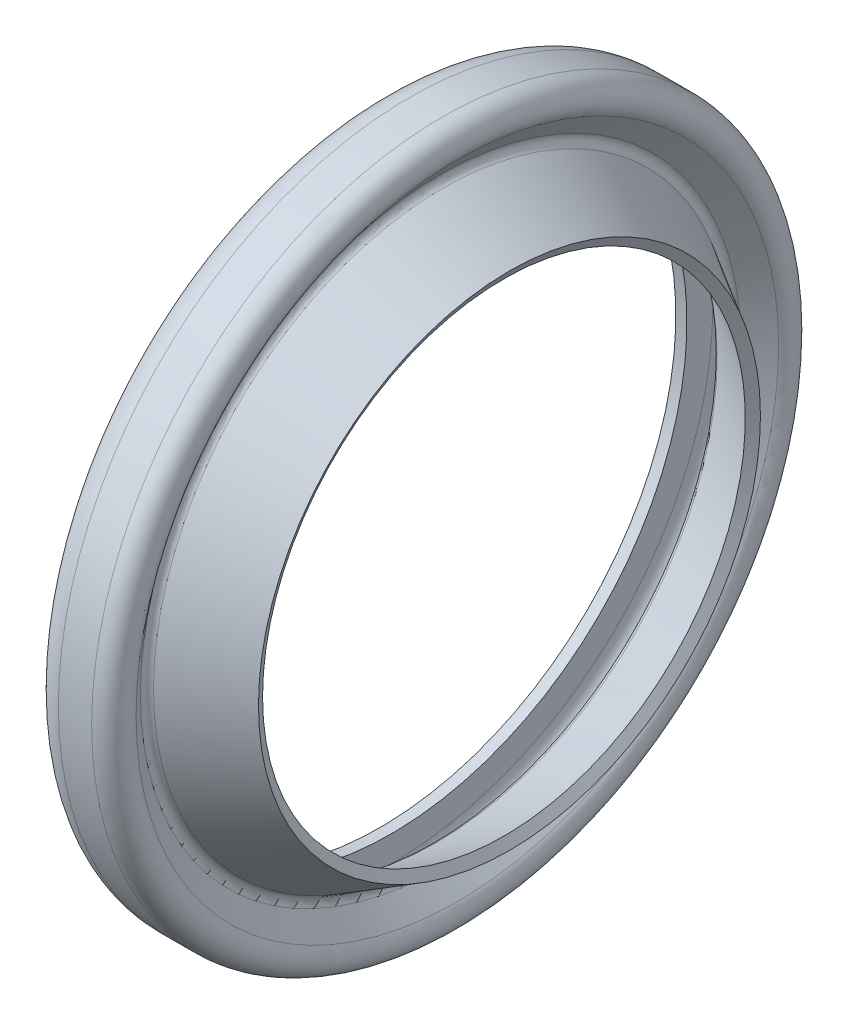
ISO-10303-21;
HEADER;
FILE_DESCRIPTION(('STEP AP214'),'2;1');
FILE_NAME('part.step','',(''),(''),'','','');
FILE_SCHEMA(('AUTOMOTIVE_DESIGN { 1 0 10303 214 1 1 1 1 }'));
ENDSEC;
DATA;
#1=APPLICATION_CONTEXT('core data for automotive mechanical design processes');
#2=APPLICATION_PROTOCOL_DEFINITION('international standard','automotive_design',2000,#1);
#3=PRODUCT_CONTEXT('',#1,'mechanical');
#4=PRODUCT('Part','Part','',(#3));
#5=PRODUCT_RELATED_PRODUCT_CATEGORY('part','',(#4));
#6=PRODUCT_DEFINITION_FORMATION('','',#4);
#7=PRODUCT_DEFINITION_CONTEXT('part definition',#1,'design');
#8=PRODUCT_DEFINITION('design','',#6,#7);
#9=PRODUCT_DEFINITION_SHAPE('','',#8);
#10=(LENGTH_UNIT() NAMED_UNIT(*) SI_UNIT(.MILLI.,.METRE.));
#11=(NAMED_UNIT(*) PLANE_ANGLE_UNIT() SI_UNIT($,.RADIAN.));
#12=(NAMED_UNIT(*) SI_UNIT($,.STERADIAN.) SOLID_ANGLE_UNIT());
#13=UNCERTAINTY_MEASURE_WITH_UNIT(LENGTH_MEASURE(1.E-05),#10,'distance_accuracy_value','');
#14=(GEOMETRIC_REPRESENTATION_CONTEXT(3) GLOBAL_UNCERTAINTY_ASSIGNED_CONTEXT((#13)) GLOBAL_UNIT_ASSIGNED_CONTEXT((#10,
#11,#12)) REPRESENTATION_CONTEXT('',''));
#15=CARTESIAN_POINT('',(0.,0.,0.));
#16=DIRECTION('',(0.,0.,1.));
#17=DIRECTION('',(1.,0.,0.));
#18=AXIS2_PLACEMENT_3D('',#15,#16,#17);
#19=CARTESIAN_POINT('',(0.,0.,0.));
#20=DIRECTION('',(-1.,0.,0.));
#21=DIRECTION('',(0.,0.,1.));
#22=AXIS2_PLACEMENT_3D('',#19,#20,#21);
#23=CYLINDRICAL_SURFACE('',#22,80.);
#24=CARTESIAN_POINT('',(3.,0.,0.));
#25=DIRECTION('',(-1.,0.,0.));
#26=DIRECTION('',(0.,0.,1.));
#27=AXIS2_PLACEMENT_3D('',#24,#25,#26);
#28=CIRCLE('',#27,80.);
#29=CARTESIAN_POINT('',(3.,0.,80.));
#30=VERTEX_POINT('',#29);
#31=EDGE_CURVE('E10',#30,#30,#28,.T.);
#32=ORIENTED_EDGE('',*,*,#31,.F.);
#33=EDGE_LOOP('',(#32));
#34=FACE_BOUND('',#33,.T.);
#35=CARTESIAN_POINT('',(0.,0.,0.));
#36=DIRECTION('',(-1.,0.,0.));
#37=DIRECTION('',(0.,0.,1.));
#38=AXIS2_PLACEMENT_3D('',#35,#36,#37);
#39=CIRCLE('',#38,80.);
#40=CARTESIAN_POINT('',(0.,0.,80.));
#41=VERTEX_POINT('',#40);
#42=EDGE_CURVE('E82',#41,#41,#39,.T.);
#43=ORIENTED_EDGE('',*,*,#42,.T.);
#44=EDGE_LOOP('',(#43));
#45=FACE_BOUND('',#44,.T.);
#46=ADVANCED_FACE('F30',(#34,#45),#23,.F.);
#47=CARTESIAN_POINT('',(3.,80.,0.));
#48=DIRECTION('',(-1.,0.,0.));
#49=DIRECTION('',(0.,0.,1.));
#50=AXIS2_PLACEMENT_3D('',#47,#48,#49);
#51=PLANE('',#50);
#52=CARTESIAN_POINT('',(3.,0.,0.));
#53=DIRECTION('',(-1.,0.,0.));
#54=DIRECTION('',(0.,0.,1.));
#55=AXIS2_PLACEMENT_3D('',#52,#53,#54);
#56=CIRCLE('',#55,87.);
#57=CARTESIAN_POINT('',(3.,0.,87.));
#58=VERTEX_POINT('',#57);
#59=EDGE_CURVE('E36',#58,#58,#56,.T.);
#60=ORIENTED_EDGE('',*,*,#59,.F.);
#61=EDGE_LOOP('',(#60));
#62=FACE_BOUND('',#61,.T.);
#63=ORIENTED_EDGE('',*,*,#31,.T.);
#64=EDGE_LOOP('',(#63));
#65=FACE_BOUND('',#64,.T.);
#66=ADVANCED_FACE('F167',(#62,#65),#51,.F.);
#67=CARTESIAN_POINT('',(8.,0.,0.));
#68=DIRECTION('',(-1.,0.,0.));
#69=DIRECTION('',(0.,0.,1.));
#70=AXIS2_PLACEMENT_3D('',#67,#68,#69);
#71=TOROIDAL_SURFACE('',#70,87.,5.);
#72=CARTESIAN_POINT('',(8.,0.,0.));
#73=DIRECTION('',(-1.,0.,0.));
#74=DIRECTION('',(0.,0.,1.));
#75=AXIS2_PLACEMENT_3D('',#72,#73,#74);
#76=CIRCLE('',#75,92.);
#77=CARTESIAN_POINT('',(8.,0.,92.));
#78=VERTEX_POINT('',#77);
#79=EDGE_CURVE('E40',#78,#78,#76,.T.);
#80=ORIENTED_EDGE('',*,*,#79,.F.);
#81=EDGE_LOOP('',(#80));
#82=FACE_BOUND('',#81,.T.);
#83=ORIENTED_EDGE('',*,*,#59,.T.);
#84=EDGE_LOOP('',(#83));
#85=FACE_BOUND('',#84,.T.);
#86=ADVANCED_FACE('F162',(#82,#85),#71,.F.);
#87=CARTESIAN_POINT('',(0.,0.,0.));
#88=DIRECTION('',(-1.,0.,0.));
#89=DIRECTION('',(0.,0.,1.));
#90=AXIS2_PLACEMENT_3D('',#87,#88,#89);
#91=CYLINDRICAL_SURFACE('',#90,92.);
#92=CARTESIAN_POINT('',(17.,0.,0.));
#93=DIRECTION('',(-1.,0.,0.));
#94=DIRECTION('',(0.,0.,1.));
#95=AXIS2_PLACEMENT_3D('',#92,#93,#94);
#96=CIRCLE('',#95,92.);
#97=CARTESIAN_POINT('',(17.,0.,92.));
#98=VERTEX_POINT('',#97);
#99=EDGE_CURVE('E44',#98,#98,#96,.T.);
#100=ORIENTED_EDGE('',*,*,#99,.F.);
#101=EDGE_LOOP('',(#100));
#102=FACE_BOUND('',#101,.T.);
#103=ORIENTED_EDGE('',*,*,#79,.T.);
#104=EDGE_LOOP('',(#103));
#105=FACE_BOUND('',#104,.T.);
#106=ADVANCED_FACE('F156',(#102,#105),#91,.F.);
#107=CARTESIAN_POINT('',(17.,0.,0.));
#108=DIRECTION('',(-1.,0.,0.));
#109=DIRECTION('',(0.,0.,1.));
#110=AXIS2_PLACEMENT_3D('',#107,#108,#109);
#111=TOROIDAL_SURFACE('',#110,90.,2.);
#112=CARTESIAN_POINT('',(18.5665549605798,0.,0.));
#113=DIRECTION('',(-1.,0.,0.));
#114=DIRECTION('',(0.,0.,1.));
#115=AXIS2_PLACEMENT_3D('',#112,#113,#114);
#116=CIRCLE('',#115,88.756655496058);
#117=CARTESIAN_POINT('',(18.5665549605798,0.,88.756655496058));
#118=VERTEX_POINT('',#117);
#119=EDGE_CURVE('E49',#118,#118,#116,.T.);
#120=ORIENTED_EDGE('',*,*,#119,.F.);
#121=EDGE_LOOP('',(#120));
#122=FACE_BOUND('',#121,.T.);
#123=ORIENTED_EDGE('',*,*,#99,.T.);
#124=EDGE_LOOP('',(#123));
#125=FACE_BOUND('',#124,.T.);
#126=ADVANCED_FACE('F150',(#122,#125),#111,.F.);
#127=CARTESIAN_POINT('',(18.5665549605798,0.,0.));
#128=DIRECTION('',(1.,0.,0.));
#129=DIRECTION('',(0.,0.,-1.));
#130=AXIS2_PLACEMENT_3D('',#127,#128,#129);
#131=CONICAL_SURFACE('',#130,88.756655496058,0.899920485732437);
#132=CARTESIAN_POINT('',(14.0836125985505,0.,0.));
#133=DIRECTION('',(-1.,0.,0.));
#134=DIRECTION('',(0.,0.,1.));
#135=AXIS2_PLACEMENT_3D('',#132,#133,#134);
#136=CIRCLE('',#135,83.1083612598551);
#137=CARTESIAN_POINT('',(14.0836125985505,0.,83.1083612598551));
#138=VERTEX_POINT('',#137);
#139=EDGE_CURVE('E52',#138,#138,#136,.T.);
#140=ORIENTED_EDGE('',*,*,#139,.F.);
#141=EDGE_LOOP('',(#140));
#142=FACE_BOUND('',#141,.T.);
#143=ORIENTED_EDGE('',*,*,#119,.T.);
#144=EDGE_LOOP('',(#143));
#145=FACE_BOUND('',#144,.T.);
#146=ADVANCED_FACE('F144',(#142,#145),#131,.T.);
#147=CARTESIAN_POINT('',(18.,0.,0.));
#148=DIRECTION('',(-1.,0.,0.));
#149=DIRECTION('',(0.,0.,1.));
#150=AXIS2_PLACEMENT_3D('',#147,#148,#149);
#151=TOROIDAL_SURFACE('',#150,80.,5.);
#152=CARTESIAN_POINT('',(15.5,0.,0.));
#153=DIRECTION('',(-1.,0.,0.));
#154=DIRECTION('',(0.,0.,1.));
#155=AXIS2_PLACEMENT_3D('',#152,#153,#154);
#156=CIRCLE('',#155,75.6698729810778);
#157=CARTESIAN_POINT('',(15.5,0.,75.6698729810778));
#158=VERTEX_POINT('',#157);
#159=EDGE_CURVE('E55',#158,#158,#156,.T.);
#160=ORIENTED_EDGE('',*,*,#159,.F.);
#161=EDGE_LOOP('',(#160));
#162=FACE_BOUND('',#161,.T.);
#163=ORIENTED_EDGE('',*,*,#139,.T.);
#164=EDGE_LOOP('',(#163));
#165=FACE_BOUND('',#164,.T.);
#166=ADVANCED_FACE('F138',(#162,#165),#151,.T.);
#167=CARTESIAN_POINT('',(15.5,0.,0.));
#168=DIRECTION('',(-1.,0.,0.));
#169=DIRECTION('',(0.,0.,1.));
#170=AXIS2_PLACEMENT_3D('',#167,#168,#169);
#171=CONICAL_SURFACE('',#170,75.6698729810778,0.523598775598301);
#172=CARTESIAN_POINT('',(33.5,0.,0.));
#173=DIRECTION('',(-1.,0.,0.));
#174=DIRECTION('',(0.,0.,1.));
#175=AXIS2_PLACEMENT_3D('',#172,#173,#174);
#176=CIRCLE('',#175,65.2775681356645);
#177=CARTESIAN_POINT('',(33.5,0.,65.2775681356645));
#178=VERTEX_POINT('',#177);
#179=EDGE_CURVE('E58',#178,#178,#176,.T.);
#180=ORIENTED_EDGE('',*,*,#179,.F.);
#181=EDGE_LOOP('',(#180));
#182=FACE_BOUND('',#181,.T.);
#183=ORIENTED_EDGE('',*,*,#159,.T.);
#184=EDGE_LOOP('',(#183));
#185=FACE_BOUND('',#184,.T.);
#186=ADVANCED_FACE('F132',(#182,#185),#171,.F.);
#187=CARTESIAN_POINT('',(33.5,0.,0.));
#188=DIRECTION('',(1.,0.,0.));
#189=DIRECTION('',(0.,0.,-1.));
#190=AXIS2_PLACEMENT_3D('',#187,#188,#189);
#191=CONICAL_SURFACE('',#190,65.2775681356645,1.0471975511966);
#192=CARTESIAN_POINT('',(35.,0.,0.));
#193=DIRECTION('',(-1.,0.,0.));
#194=DIRECTION('',(0.,0.,1.));
#195=AXIS2_PLACEMENT_3D('',#192,#193,#194);
#196=CIRCLE('',#195,67.8756443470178);
#197=CARTESIAN_POINT('',(35.,0.,67.8756443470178));
#198=VERTEX_POINT('',#197);
#199=EDGE_CURVE('E61',#198,#198,#196,.T.);
#200=ORIENTED_EDGE('',*,*,#199,.F.);
#201=EDGE_LOOP('',(#200));
#202=FACE_BOUND('',#201,.T.);
#203=ORIENTED_EDGE('',*,*,#179,.T.);
#204=EDGE_LOOP('',(#203));
#205=FACE_BOUND('',#204,.T.);
#206=ADVANCED_FACE('F126',(#202,#205),#191,.F.);
#207=CARTESIAN_POINT('',(35.,0.,0.));
#208=DIRECTION('',(-1.,0.,0.));
#209=DIRECTION('',(0.,0.,1.));
#210=AXIS2_PLACEMENT_3D('',#207,#208,#209);
#211=CONICAL_SURFACE('',#210,67.8756443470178,0.5235987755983);
#212=CARTESIAN_POINT('',(17.,0.,0.));
#213=DIRECTION('',(-1.,0.,0.));
#214=DIRECTION('',(0.,0.,1.));
#215=AXIS2_PLACEMENT_3D('',#212,#213,#214);
#216=CIRCLE('',#215,78.2679491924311);
#217=CARTESIAN_POINT('',(17.,0.,78.2679491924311));
#218=VERTEX_POINT('',#217);
#219=EDGE_CURVE('E64',#218,#218,#216,.T.);
#220=ORIENTED_EDGE('',*,*,#219,.F.);
#221=EDGE_LOOP('',(#220));
#222=FACE_BOUND('',#221,.T.);
#223=ORIENTED_EDGE('',*,*,#199,.T.);
#224=EDGE_LOOP('',(#223));
#225=FACE_BOUND('',#224,.T.);
#226=ADVANCED_FACE('F120',(#222,#225),#211,.T.);
#227=CARTESIAN_POINT('',(18.,0.,0.));
#228=DIRECTION('',(-1.,0.,0.));
#229=DIRECTION('',(0.,0.,1.));
#230=AXIS2_PLACEMENT_3D('',#227,#228,#229);
#231=TOROIDAL_SURFACE('',#230,80.,2.);
#232=CARTESIAN_POINT('',(16.4334450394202,0.,0.));
#233=DIRECTION('',(-1.,0.,0.));
#234=DIRECTION('',(0.,0.,1.));
#235=AXIS2_PLACEMENT_3D('',#232,#233,#234);
#236=CIRCLE('',#235,81.243344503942);
#237=CARTESIAN_POINT('',(16.4334450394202,0.,81.243344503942));
#238=VERTEX_POINT('',#237);
#239=EDGE_CURVE('E67',#238,#238,#236,.T.);
#240=ORIENTED_EDGE('',*,*,#239,.F.);
#241=EDGE_LOOP('',(#240));
#242=FACE_BOUND('',#241,.T.);
#243=ORIENTED_EDGE('',*,*,#219,.T.);
#244=EDGE_LOOP('',(#243));
#245=FACE_BOUND('',#244,.T.);
#246=ADVANCED_FACE('F114',(#242,#245),#231,.F.);
#247=CARTESIAN_POINT('',(16.4334450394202,0.,0.));
#248=DIRECTION('',(1.,0.,0.));
#249=DIRECTION('',(0.,0.,-1.));
#250=AXIS2_PLACEMENT_3D('',#247,#248,#249);
#251=CONICAL_SURFACE('',#250,81.243344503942,0.899920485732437);
#252=CARTESIAN_POINT('',(20.9163874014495,0.,0.));
#253=DIRECTION('',(-1.,0.,0.));
#254=DIRECTION('',(0.,0.,1.));
#255=AXIS2_PLACEMENT_3D('',#252,#253,#254);
#256=CIRCLE('',#255,86.891638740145);
#257=CARTESIAN_POINT('',(20.9163874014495,0.,86.891638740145));
#258=VERTEX_POINT('',#257);
#259=EDGE_CURVE('E70',#258,#258,#256,.T.);
#260=ORIENTED_EDGE('',*,*,#259,.F.);
#261=EDGE_LOOP('',(#260));
#262=FACE_BOUND('',#261,.T.);
#263=ORIENTED_EDGE('',*,*,#239,.T.);
#264=EDGE_LOOP('',(#263));
#265=FACE_BOUND('',#264,.T.);
#266=ADVANCED_FACE('F108',(#262,#265),#251,.F.);
#267=CARTESIAN_POINT('',(17.,0.,0.));
#268=DIRECTION('',(-1.,0.,0.));
#269=DIRECTION('',(0.,0.,1.));
#270=AXIS2_PLACEMENT_3D('',#267,#268,#269);
#271=TOROIDAL_SURFACE('',#270,90.,5.);
#272=CARTESIAN_POINT('',(17.,0.,0.));
#273=DIRECTION('',(-1.,0.,0.));
#274=DIRECTION('',(0.,0.,1.));
#275=AXIS2_PLACEMENT_3D('',#272,#273,#274);
#276=CIRCLE('',#275,95.);
#277=CARTESIAN_POINT('',(17.,0.,95.));
#278=VERTEX_POINT('',#277);
#279=EDGE_CURVE('E73',#278,#278,#276,.T.);
#280=ORIENTED_EDGE('',*,*,#279,.F.);
#281=EDGE_LOOP('',(#280));
#282=FACE_BOUND('',#281,.T.);
#283=ORIENTED_EDGE('',*,*,#259,.T.);
#284=EDGE_LOOP('',(#283));
#285=FACE_BOUND('',#284,.T.);
#286=ADVANCED_FACE('F102',(#282,#285),#271,.T.);
#287=CARTESIAN_POINT('',(0.,0.,0.));
#288=DIRECTION('',(-1.,0.,0.));
#289=DIRECTION('',(0.,0.,1.));
#290=AXIS2_PLACEMENT_3D('',#287,#288,#289);
#291=CYLINDRICAL_SURFACE('',#290,95.);
#292=CARTESIAN_POINT('',(8.,0.,0.));
#293=DIRECTION('',(-1.,0.,0.));
#294=DIRECTION('',(0.,0.,1.));
#295=AXIS2_PLACEMENT_3D('',#292,#293,#294);
#296=CIRCLE('',#295,95.);
#297=CARTESIAN_POINT('',(8.,0.,95.));
#298=VERTEX_POINT('',#297);
#299=EDGE_CURVE('E76',#298,#298,#296,.T.);
#300=ORIENTED_EDGE('',*,*,#299,.F.);
#301=EDGE_LOOP('',(#300));
#302=FACE_BOUND('',#301,.T.);
#303=ORIENTED_EDGE('',*,*,#279,.T.);
#304=EDGE_LOOP('',(#303));
#305=FACE_BOUND('',#304,.T.);
#306=ADVANCED_FACE('F96',(#302,#305),#291,.T.);
#307=CARTESIAN_POINT('',(8.,0.,0.));
#308=DIRECTION('',(-1.,0.,0.));
#309=DIRECTION('',(0.,0.,1.));
#310=AXIS2_PLACEMENT_3D('',#307,#308,#309);
#311=TOROIDAL_SURFACE('',#310,87.,8.00000000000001);
#312=CARTESIAN_POINT('',(0.,0.,0.));
#313=DIRECTION('',(-1.,0.,0.));
#314=DIRECTION('',(0.,0.,1.));
#315=AXIS2_PLACEMENT_3D('',#312,#313,#314);
#316=CIRCLE('',#315,87.);
#317=CARTESIAN_POINT('',(0.,0.,87.));
#318=VERTEX_POINT('',#317);
#319=EDGE_CURVE('E79',#318,#318,#316,.T.);
#320=ORIENTED_EDGE('',*,*,#319,.F.);
#321=EDGE_LOOP('',(#320));
#322=FACE_BOUND('',#321,.T.);
#323=ORIENTED_EDGE('',*,*,#299,.T.);
#324=EDGE_LOOP('',(#323));
#325=FACE_BOUND('',#324,.T.);
#326=ADVANCED_FACE('F90',(#322,#325),#311,.T.);
#327=CARTESIAN_POINT('',(0.,80.,0.));
#328=DIRECTION('',(1.,0.,0.));
#329=DIRECTION('',(0.,0.,-1.));
#330=AXIS2_PLACEMENT_3D('',#327,#328,#329);
#331=PLANE('',#330);
#332=ORIENTED_EDGE('',*,*,#42,.F.);
#333=EDGE_LOOP('',(#332));
#334=FACE_BOUND('',#333,.T.);
#335=ORIENTED_EDGE('',*,*,#319,.T.);
#336=EDGE_LOOP('',(#335));
#337=FACE_BOUND('',#336,.T.);
#338=ADVANCED_FACE('F87',(#334,#337),#331,.F.);
#339=CLOSED_SHELL('',(#46,#66,#86,#106,#126,#146,#166,#186,#206,#226,#246,#266,#286,#306,#326,#338));
#340=MANIFOLD_SOLID_BREP('B2',#339);
#341=ADVANCED_BREP_SHAPE_REPRESENTATION('',(#18,#340),#14);
#342=SHAPE_DEFINITION_REPRESENTATION(#9,#341);
ENDSEC;
END-ISO-10303-21;
